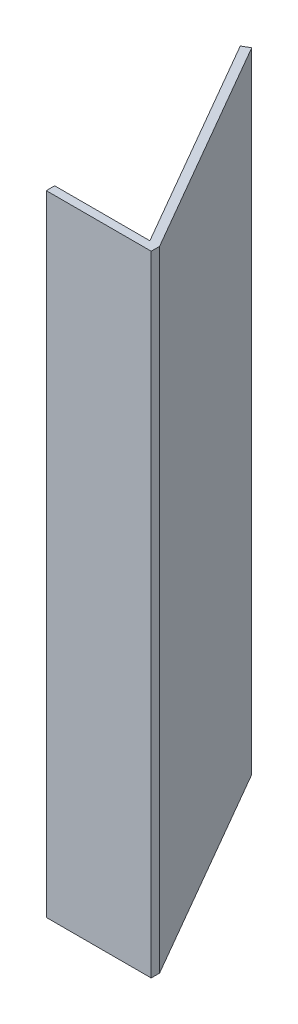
ISO-10303-21;
HEADER;
FILE_DESCRIPTION(('STEP AP214'),'2;1');
FILE_NAME('part.step','',(''),(''),'','','');
FILE_SCHEMA(('AUTOMOTIVE_DESIGN { 1 0 10303 214 1 1 1 1 }'));
ENDSEC;
DATA;
#1=APPLICATION_CONTEXT('core data for automotive mechanical design processes');
#2=APPLICATION_PROTOCOL_DEFINITION('international standard','automotive_design',2000,#1);
#3=PRODUCT_CONTEXT('',#1,'mechanical');
#4=PRODUCT('Part','Part','',(#3));
#5=PRODUCT_RELATED_PRODUCT_CATEGORY('part','',(#4));
#6=PRODUCT_DEFINITION_FORMATION('','',#4);
#7=PRODUCT_DEFINITION_CONTEXT('part definition',#1,'design');
#8=PRODUCT_DEFINITION('design','',#6,#7);
#9=PRODUCT_DEFINITION_SHAPE('','',#8);
#10=(LENGTH_UNIT() NAMED_UNIT(*) SI_UNIT(.MILLI.,.METRE.));
#11=(NAMED_UNIT(*) PLANE_ANGLE_UNIT() SI_UNIT($,.RADIAN.));
#12=(NAMED_UNIT(*) SI_UNIT($,.STERADIAN.) SOLID_ANGLE_UNIT());
#13=UNCERTAINTY_MEASURE_WITH_UNIT(LENGTH_MEASURE(1.E-05),#10,'distance_accuracy_value','');
#14=(GEOMETRIC_REPRESENTATION_CONTEXT(3) GLOBAL_UNCERTAINTY_ASSIGNED_CONTEXT((#13)) GLOBAL_UNIT_ASSIGNED_CONTEXT((#10,
#11,#12)) REPRESENTATION_CONTEXT('',''));
#15=CARTESIAN_POINT('',(0.,0.,0.));
#16=DIRECTION('',(0.,0.,1.));
#17=DIRECTION('',(1.,0.,0.));
#18=AXIS2_PLACEMENT_3D('',#15,#16,#17);
#19=CARTESIAN_POINT('',(0.,150.,-2.));
#20=DIRECTION('',(1.,0.,0.));
#21=DIRECTION('',(0.,0.,-1.));
#22=AXIS2_PLACEMENT_3D('',#19,#20,#21);
#23=PLANE('',#22);
#24=DIRECTION('',(0.,0.,1.));
#25=VECTOR('',#24,1.);
#26=CARTESIAN_POINT('',(0.,0.,-2.));
#27=LINE('',#26,#25);
#28=CARTESIAN_POINT('',(0.,0.,-2.));
#29=VERTEX_POINT('',#28);
#30=CARTESIAN_POINT('',(0.,0.,0.));
#31=VERTEX_POINT('',#30);
#32=EDGE_CURVE('E125',#29,#31,#27,.T.);
#33=ORIENTED_EDGE('',*,*,#32,.T.);
#34=DIRECTION('',(0.,-1.,0.));
#35=VECTOR('',#34,1.);
#36=CARTESIAN_POINT('',(0.,150.,0.));
#37=LINE('',#36,#35);
#38=CARTESIAN_POINT('',(0.,150.,0.));
#39=VERTEX_POINT('',#38);
#40=EDGE_CURVE('E11',#39,#31,#37,.T.);
#41=ORIENTED_EDGE('',*,*,#40,.F.);
#42=DIRECTION('',(0.,0.,1.));
#43=VECTOR('',#42,1.);
#44=CARTESIAN_POINT('',(0.,150.,-2.));
#45=LINE('',#44,#43);
#46=CARTESIAN_POINT('',(0.,150.,-2.));
#47=VERTEX_POINT('',#46);
#48=EDGE_CURVE('E137',#47,#39,#45,.T.);
#49=ORIENTED_EDGE('',*,*,#48,.F.);
#50=DIRECTION('',(0.,-1.,0.));
#51=VECTOR('',#50,1.);
#52=CARTESIAN_POINT('',(0.,150.,-2.));
#53=LINE('',#52,#51);
#54=EDGE_CURVE('E121',#47,#29,#53,.T.);
#55=ORIENTED_EDGE('',*,*,#54,.T.);
#56=EDGE_LOOP('',(#33,#41,#49,#55));
#57=FACE_BOUND('',#56,.T.);
#58=ADVANCED_FACE('F35',(#57),#23,.F.);
#59=CARTESIAN_POINT('',(0.,150.,0.));
#60=DIRECTION('',(0.,0.,-1.));
#61=DIRECTION('',(-1.,0.,0.));
#62=AXIS2_PLACEMENT_3D('',#59,#60,#61);
#63=PLANE('',#62);
#64=DIRECTION('',(1.,0.,0.));
#65=VECTOR('',#64,1.);
#66=CARTESIAN_POINT('',(0.,0.,0.));
#67=LINE('',#66,#65);
#68=CARTESIAN_POINT('',(25.,0.,0.));
#69=VERTEX_POINT('',#68);
#70=EDGE_CURVE('E128',#31,#69,#67,.T.);
#71=ORIENTED_EDGE('',*,*,#70,.T.);
#72=DIRECTION('',(0.,-1.,0.));
#73=VECTOR('',#72,1.);
#74=CARTESIAN_POINT('',(25.,150.,0.));
#75=LINE('',#74,#73);
#76=CARTESIAN_POINT('',(25.,150.,0.));
#77=VERTEX_POINT('',#76);
#78=EDGE_CURVE('E43',#77,#69,#75,.T.);
#79=ORIENTED_EDGE('',*,*,#78,.F.);
#80=DIRECTION('',(1.,0.,0.));
#81=VECTOR('',#80,1.);
#82=CARTESIAN_POINT('',(0.,150.,0.));
#83=LINE('',#82,#81);
#84=EDGE_CURVE('E91',#39,#77,#83,.T.);
#85=ORIENTED_EDGE('',*,*,#84,.F.);
#86=ORIENTED_EDGE('',*,*,#40,.T.);
#87=EDGE_LOOP('',(#71,#79,#85,#86));
#88=FACE_BOUND('',#87,.T.);
#89=ADVANCED_FACE('F162',(#88),#63,.F.);
#90=CARTESIAN_POINT('',(25.,150.,0.));
#91=DIRECTION('',(-1.,0.,0.));
#92=DIRECTION('',(0.,0.,1.));
#93=AXIS2_PLACEMENT_3D('',#90,#91,#92);
#94=PLANE('',#93);
#95=DIRECTION('',(0.,0.,-1.));
#96=VECTOR('',#95,1.);
#97=CARTESIAN_POINT('',(25.,0.,0.));
#98=LINE('',#97,#96);
#99=CARTESIAN_POINT('',(25.,0.,-2.));
#100=VERTEX_POINT('',#99);
#101=EDGE_CURVE('E130',#69,#100,#98,.T.);
#102=ORIENTED_EDGE('',*,*,#101,.T.);
#103=DIRECTION('',(0.,-1.,0.));
#104=VECTOR('',#103,1.);
#105=CARTESIAN_POINT('',(25.,150.,-2.));
#106=LINE('',#105,#104);
#107=CARTESIAN_POINT('',(25.,150.,-2.));
#108=VERTEX_POINT('',#107);
#109=EDGE_CURVE('E141',#108,#100,#106,.T.);
#110=ORIENTED_EDGE('',*,*,#109,.F.);
#111=DIRECTION('',(0.,0.,-1.));
#112=VECTOR('',#111,1.);
#113=CARTESIAN_POINT('',(25.,150.,0.));
#114=LINE('',#113,#112);
#115=EDGE_CURVE('E149',#77,#108,#114,.T.);
#116=ORIENTED_EDGE('',*,*,#115,.F.);
#117=ORIENTED_EDGE('',*,*,#78,.T.);
#118=EDGE_LOOP('',(#102,#110,#116,#117));
#119=FACE_BOUND('',#118,.T.);
#120=ADVANCED_FACE('F147',(#119),#94,.F.);
#121=CARTESIAN_POINT('',(25.,150.,-2.));
#122=DIRECTION('',(-0.866025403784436,0.,0.500000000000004));
#123=DIRECTION('',(0.500000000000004,0.,0.866025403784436));
#124=AXIS2_PLACEMENT_3D('',#121,#122,#123);
#125=PLANE('',#124);
#126=DIRECTION('',(-0.500000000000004,0.,-0.866025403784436));
#127=VECTOR('',#126,1.);
#128=CARTESIAN_POINT('',(25.,0.,-2.));
#129=LINE('',#128,#127);
#130=CARTESIAN_POINT('',(-5.00000000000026,0.,-53.9615242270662));
#131=VERTEX_POINT('',#130);
#132=EDGE_CURVE('E132',#100,#131,#129,.T.);
#133=ORIENTED_EDGE('',*,*,#132,.T.);
#134=DIRECTION('',(0.,-1.,0.));
#135=VECTOR('',#134,1.);
#136=CARTESIAN_POINT('',(-5.00000000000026,150.,-53.9615242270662));
#137=LINE('',#136,#135);
#138=CARTESIAN_POINT('',(-5.00000000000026,150.,-53.9615242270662));
#139=VERTEX_POINT('',#138);
#140=EDGE_CURVE('E116',#139,#131,#137,.T.);
#141=ORIENTED_EDGE('',*,*,#140,.F.);
#142=DIRECTION('',(-0.500000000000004,0.,-0.866025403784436));
#143=VECTOR('',#142,1.);
#144=CARTESIAN_POINT('',(25.,150.,-2.));
#145=LINE('',#144,#143);
#146=EDGE_CURVE('E107',#108,#139,#145,.T.);
#147=ORIENTED_EDGE('',*,*,#146,.F.);
#148=ORIENTED_EDGE('',*,*,#109,.T.);
#149=EDGE_LOOP('',(#133,#141,#147,#148));
#150=FACE_BOUND('',#149,.T.);
#151=ADVANCED_FACE('F155',(#150),#125,.F.);
#152=CARTESIAN_POINT('',(-5.00000000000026,150.,-53.9615242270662));
#153=DIRECTION('',(0.500000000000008,0.,0.866025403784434));
#154=DIRECTION('',(0.866025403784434,0.,-0.500000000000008));
#155=AXIS2_PLACEMENT_3D('',#152,#153,#154);
#156=PLANE('',#155);
#157=DIRECTION('',(-0.866025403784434,0.,0.500000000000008));
#158=VECTOR('',#157,1.);
#159=CARTESIAN_POINT('',(-5.00000000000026,0.,-53.9615242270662));
#160=LINE('',#159,#158);
#161=CARTESIAN_POINT('',(-6.73205080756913,0.,-52.9615242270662));
#162=VERTEX_POINT('',#161);
#163=EDGE_CURVE('E115',#131,#162,#160,.T.);
#164=ORIENTED_EDGE('',*,*,#163,.T.);
#165=DIRECTION('',(0.,-1.,0.));
#166=VECTOR('',#165,1.);
#167=CARTESIAN_POINT('',(-6.73205080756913,150.,-52.9615242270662));
#168=LINE('',#167,#166);
#169=CARTESIAN_POINT('',(-6.73205080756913,150.,-52.9615242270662));
#170=VERTEX_POINT('',#169);
#171=EDGE_CURVE('E112',#170,#162,#168,.T.);
#172=ORIENTED_EDGE('',*,*,#171,.F.);
#173=DIRECTION('',(-0.866025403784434,0.,0.500000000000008));
#174=VECTOR('',#173,1.);
#175=CARTESIAN_POINT('',(-5.00000000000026,150.,-53.9615242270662));
#176=LINE('',#175,#174);
#177=EDGE_CURVE('E101',#139,#170,#176,.T.);
#178=ORIENTED_EDGE('',*,*,#177,.F.);
#179=ORIENTED_EDGE('',*,*,#140,.T.);
#180=EDGE_LOOP('',(#164,#172,#178,#179));
#181=FACE_BOUND('',#180,.T.);
#182=ADVANCED_FACE('F113',(#181),#156,.F.);
#183=CARTESIAN_POINT('',(-6.73205080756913,150.,-52.9615242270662));
#184=DIRECTION('',(0.866025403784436,0.,-0.500000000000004));
#185=DIRECTION('',(-0.500000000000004,0.,-0.866025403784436));
#186=AXIS2_PLACEMENT_3D('',#183,#184,#185);
#187=PLANE('',#186);
#188=DIRECTION('',(0.500000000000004,0.,0.866025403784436));
#189=VECTOR('',#188,1.);
#190=CARTESIAN_POINT('',(-6.73205080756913,0.,-52.9615242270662));
#191=LINE('',#190,#189);
#192=CARTESIAN_POINT('',(22.6905989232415,0.,-2.));
#193=VERTEX_POINT('',#192);
#194=EDGE_CURVE('E77',#162,#193,#191,.T.);
#195=ORIENTED_EDGE('',*,*,#194,.T.);
#196=DIRECTION('',(0.,-1.,0.));
#197=VECTOR('',#196,1.);
#198=CARTESIAN_POINT('',(22.6905989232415,150.,-2.));
#199=LINE('',#198,#197);
#200=CARTESIAN_POINT('',(22.6905989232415,150.,-2.));
#201=VERTEX_POINT('',#200);
#202=EDGE_CURVE('E117',#201,#193,#199,.T.);
#203=ORIENTED_EDGE('',*,*,#202,.F.);
#204=DIRECTION('',(0.500000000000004,0.,0.866025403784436));
#205=VECTOR('',#204,1.);
#206=CARTESIAN_POINT('',(-6.73205080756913,150.,-52.9615242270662));
#207=LINE('',#206,#205);
#208=EDGE_CURVE('E105',#170,#201,#207,.T.);
#209=ORIENTED_EDGE('',*,*,#208,.F.);
#210=ORIENTED_EDGE('',*,*,#171,.T.);
#211=EDGE_LOOP('',(#195,#203,#209,#210));
#212=FACE_BOUND('',#211,.T.);
#213=ADVANCED_FACE('F119',(#212),#187,.F.);
#214=CARTESIAN_POINT('',(22.6905989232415,150.,-2.));
#215=DIRECTION('',(0.,0.,1.));
#216=DIRECTION('',(1.,0.,0.));
#217=AXIS2_PLACEMENT_3D('',#214,#215,#216);
#218=PLANE('',#217);
#219=DIRECTION('',(-1.,0.,0.));
#220=VECTOR('',#219,1.);
#221=CARTESIAN_POINT('',(22.6905989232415,0.,-2.));
#222=LINE('',#221,#220);
#223=EDGE_CURVE('E83',#193,#29,#222,.T.);
#224=ORIENTED_EDGE('',*,*,#223,.T.);
#225=ORIENTED_EDGE('',*,*,#54,.F.);
#226=DIRECTION('',(-1.,0.,0.));
#227=VECTOR('',#226,1.);
#228=CARTESIAN_POINT('',(22.6905989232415,150.,-2.));
#229=LINE('',#228,#227);
#230=EDGE_CURVE('E51',#201,#47,#229,.T.);
#231=ORIENTED_EDGE('',*,*,#230,.F.);
#232=ORIENTED_EDGE('',*,*,#202,.T.);
#233=EDGE_LOOP('',(#224,#225,#231,#232));
#234=FACE_BOUND('',#233,.T.);
#235=ADVANCED_FACE('F176',(#234),#218,.F.);
#236=CARTESIAN_POINT('',(0.,150.,0.));
#237=DIRECTION('',(0.,1.,0.));
#238=DIRECTION('',(0.,0.,1.));
#239=AXIS2_PLACEMENT_3D('',#236,#237,#238);
#240=PLANE('',#239);
#241=ORIENTED_EDGE('',*,*,#48,.T.);
#242=ORIENTED_EDGE('',*,*,#84,.T.);
#243=ORIENTED_EDGE('',*,*,#115,.T.);
#244=ORIENTED_EDGE('',*,*,#146,.T.);
#245=ORIENTED_EDGE('',*,*,#177,.T.);
#246=ORIENTED_EDGE('',*,*,#208,.T.);
#247=ORIENTED_EDGE('',*,*,#230,.T.);
#248=EDGE_LOOP('',(#241,#242,#243,#244,#245,#246,#247));
#249=FACE_BOUND('',#248,.T.);
#250=ADVANCED_FACE('F103',(#249),#240,.T.);
#251=CARTESIAN_POINT('',(0.,0.,0.));
#252=DIRECTION('',(0.,1.,0.));
#253=DIRECTION('',(0.,0.,1.));
#254=AXIS2_PLACEMENT_3D('',#251,#252,#253);
#255=PLANE('',#254);
#256=ORIENTED_EDGE('',*,*,#32,.F.);
#257=ORIENTED_EDGE('',*,*,#223,.F.);
#258=ORIENTED_EDGE('',*,*,#194,.F.);
#259=ORIENTED_EDGE('',*,*,#163,.F.);
#260=ORIENTED_EDGE('',*,*,#132,.F.);
#261=ORIENTED_EDGE('',*,*,#101,.F.);
#262=ORIENTED_EDGE('',*,*,#70,.F.);
#263=EDGE_LOOP('',(#256,#257,#258,#259,#260,#261,#262));
#264=FACE_BOUND('',#263,.T.);
#265=ADVANCED_FACE('F153',(#264),#255,.F.);
#266=CLOSED_SHELL('',(#58,#89,#120,#151,#182,#213,#235,#250,#265));
#267=MANIFOLD_SOLID_BREP('B2',#266);
#268=ADVANCED_BREP_SHAPE_REPRESENTATION('',(#18,#267),#14);
#269=SHAPE_DEFINITION_REPRESENTATION(#9,#268);
ENDSEC;
END-ISO-10303-21;
